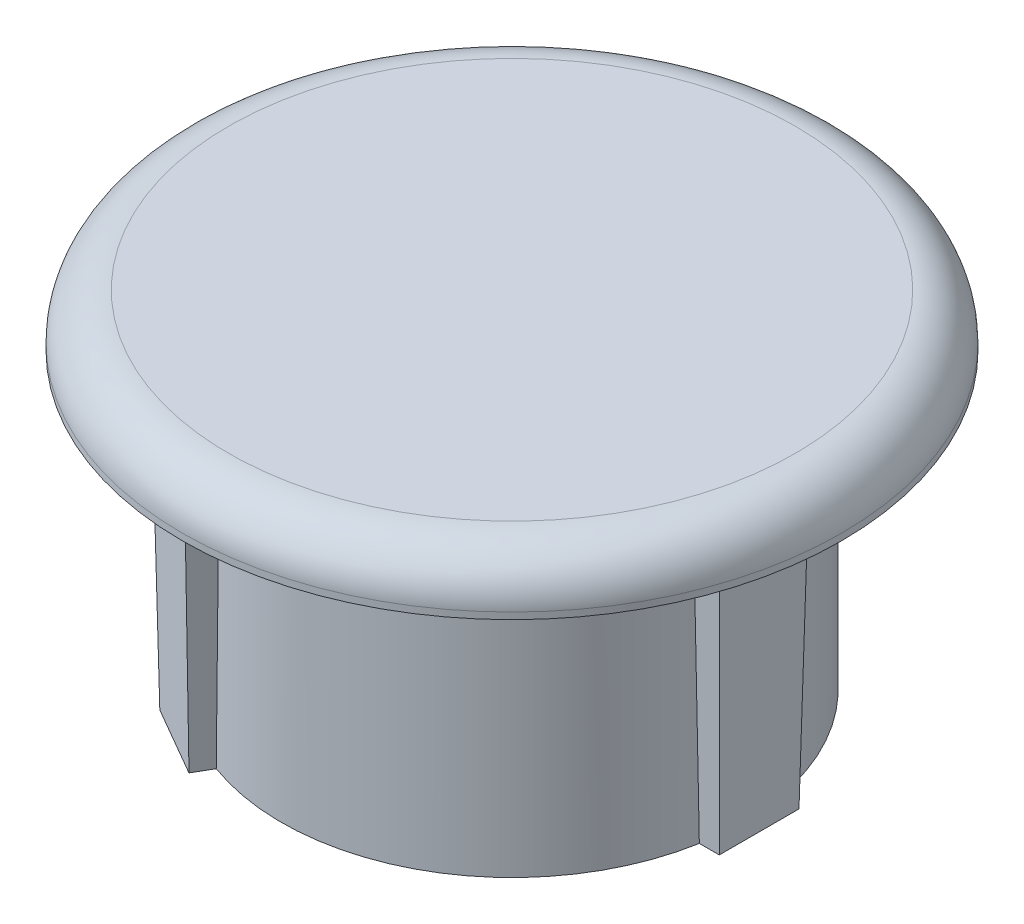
ISO-10303-21;
HEADER;
FILE_DESCRIPTION(('STEP AP214'),'2;1');
FILE_NAME('part.step','',(''),(''),'','','');
FILE_SCHEMA(('AUTOMOTIVE_DESIGN { 1 0 10303 214 1 1 1 1 }'));
ENDSEC;
DATA;
#1=APPLICATION_CONTEXT('core data for automotive mechanical design processes');
#2=APPLICATION_PROTOCOL_DEFINITION('international standard','automotive_design',2000,#1);
#3=PRODUCT_CONTEXT('',#1,'mechanical');
#4=PRODUCT('Part','Part','',(#3));
#5=PRODUCT_RELATED_PRODUCT_CATEGORY('part','',(#4));
#6=PRODUCT_DEFINITION_FORMATION('','',#4);
#7=PRODUCT_DEFINITION_CONTEXT('part definition',#1,'design');
#8=PRODUCT_DEFINITION('design','',#6,#7);
#9=PRODUCT_DEFINITION_SHAPE('','',#8);
#10=(LENGTH_UNIT() NAMED_UNIT(*) SI_UNIT(.MILLI.,.METRE.));
#11=(NAMED_UNIT(*) PLANE_ANGLE_UNIT() SI_UNIT($,.RADIAN.));
#12=(NAMED_UNIT(*) SI_UNIT($,.STERADIAN.) SOLID_ANGLE_UNIT());
#13=UNCERTAINTY_MEASURE_WITH_UNIT(LENGTH_MEASURE(1.E-05),#10,'distance_accuracy_value','');
#14=(GEOMETRIC_REPRESENTATION_CONTEXT(3) GLOBAL_UNCERTAINTY_ASSIGNED_CONTEXT((#13)) GLOBAL_UNIT_ASSIGNED_CONTEXT((#10,
#11,#12)) REPRESENTATION_CONTEXT('',''));
#15=CARTESIAN_POINT('',(0.,0.,0.));
#16=DIRECTION('',(0.,0.,1.));
#17=DIRECTION('',(1.,0.,0.));
#18=AXIS2_PLACEMENT_3D('',#15,#16,#17);
#19=CARTESIAN_POINT('',(0.,0.,0.));
#20=DIRECTION('',(0.,-1.,0.));
#21=DIRECTION('',(0.,0.,-1.));
#22=AXIS2_PLACEMENT_3D('',#19,#20,#21);
#23=CYLINDRICAL_SURFACE('',#22,3.5);
#24=CARTESIAN_POINT('',(0.,-34.6488843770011,0.));
#25=DIRECTION('',(0.865893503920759,-0.0174524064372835,0.499923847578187));
#26=DIRECTION('',(-0.0151142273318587,-0.999847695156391,-0.00872620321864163));
#27=AXIS2_PLACEMENT_3D('',#24,#25,#26);
#28=ELLIPSE('',#27,200.545409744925,3.5);
#29=CARTESIAN_POINT('',(-1.19990387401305,0.,3.28789152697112));
#30=VERTEX_POINT('',#29);
#31=CARTESIAN_POINT('',(-1.12536885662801,4.45,3.31414316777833));
#32=VERTEX_POINT('',#31);
#33=EDGE_CURVE('E147',#30,#32,#28,.F.);
#34=ORIENTED_EDGE('',*,*,#33,.F.);
#35=CARTESIAN_POINT('',(0.,0.,0.));
#36=DIRECTION('',(0.,-1.,0.));
#37=DIRECTION('',(0.,0.,-1.));
#38=AXIS2_PLACEMENT_3D('',#35,#36,#37);
#39=CIRCLE('',#38,3.5);
#40=CARTESIAN_POINT('',(3.44734952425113,0.,0.604798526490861));
#41=VERTEX_POINT('',#40);
#42=EDGE_CURVE('E204',#41,#30,#39,.T.);
#43=ORIENTED_EDGE('',*,*,#42,.F.);
#44=CARTESIAN_POINT('',(0.,-34.6488843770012,0.));
#45=DIRECTION('',(0.,-0.0174524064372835,0.999847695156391));
#46=DIRECTION('',(0.,-0.999847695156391,-0.0174524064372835));
#47=AXIS2_PLACEMENT_3D('',#44,#45,#46);
#48=ELLIPSE('',#47,200.545409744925,3.5);
#49=CARTESIAN_POINT('',(3.43281660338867,4.45,0.68247356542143));
#50=VERTEX_POINT('',#49);
#51=EDGE_CURVE('E194',#50,#41,#48,.F.);
#52=ORIENTED_EDGE('',*,*,#51,.F.);
#53=CARTESIAN_POINT('',(0.,4.45,0.));
#54=DIRECTION('',(0.,-1.,0.));
#55=DIRECTION('',(0.,0.,-1.));
#56=AXIS2_PLACEMENT_3D('',#53,#54,#55);
#57=CIRCLE('',#56,3.5);
#58=EDGE_CURVE('E208',#50,#32,#57,.T.);
#59=ORIENTED_EDGE('',*,*,#58,.T.);
#60=EDGE_LOOP('',(#34,#43,#52,#59));
#61=FACE_BOUND('',#60,.T.);
#62=ADVANCED_FACE('F27',(#61),#23,.T.);
#63=CARTESIAN_POINT('',(0.,-34.6488843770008,0.));
#64=DIRECTION('',(-0.865893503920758,-0.0174524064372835,-0.499923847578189));
#65=DIRECTION('',(0.0151142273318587,-0.999847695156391,0.00872620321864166));
#66=AXIS2_PLACEMENT_3D('',#63,#64,#65);
#67=ELLIPSE('',#66,200.545409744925,3.5);
#68=CARTESIAN_POINT('',(-2.30744774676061,4.45,2.63166960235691));
#69=VERTEX_POINT('',#68);
#70=CARTESIAN_POINT('',(-2.24744565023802,0.,2.68309300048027));
#71=VERTEX_POINT('',#70);
#72=EDGE_CURVE('E131',#69,#71,#67,.F.);
#73=ORIENTED_EDGE('',*,*,#72,.F.);
#74=CARTESIAN_POINT('',(-2.30744774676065,4.45,-2.63166960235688));
#75=VERTEX_POINT('',#74);
#76=EDGE_CURVE('E212',#69,#75,#57,.T.);
#77=ORIENTED_EDGE('',*,*,#76,.T.);
#78=CARTESIAN_POINT('',(0.,-34.6488843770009,0.));
#79=DIRECTION('',(-0.865893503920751,-0.0174524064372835,0.499923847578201));
#80=DIRECTION('',(0.0151142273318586,-0.999847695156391,-0.00872620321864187));
#81=AXIS2_PLACEMENT_3D('',#78,#79,#80);
#82=ELLIPSE('',#81,200.545409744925,3.5);
#83=CARTESIAN_POINT('',(-2.24744565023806,0.,-2.68309300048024));
#84=VERTEX_POINT('',#83);
#85=EDGE_CURVE('E170',#84,#75,#82,.F.);
#86=ORIENTED_EDGE('',*,*,#85,.F.);
#87=EDGE_CURVE('E207',#71,#84,#39,.T.);
#88=ORIENTED_EDGE('',*,*,#87,.F.);
#89=EDGE_LOOP('',(#73,#77,#86,#88));
#90=FACE_BOUND('',#89,.T.);
#91=ADVANCED_FACE('F235',(#90),#23,.T.);
#92=CARTESIAN_POINT('',(0.,0.,0.));
#93=DIRECTION('',(0.,-1.,0.));
#94=DIRECTION('',(0.,0.,-1.));
#95=AXIS2_PLACEMENT_3D('',#92,#93,#94);
#96=CYLINDRICAL_SURFACE('',#95,2.3);
#97=CARTESIAN_POINT('',(0.,0.,0.));
#98=DIRECTION('',(0.,-1.,0.));
#99=DIRECTION('',(0.,0.,-1.));
#100=AXIS2_PLACEMENT_3D('',#97,#98,#99);
#101=CIRCLE('',#100,2.3);
#102=CARTESIAN_POINT('',(0.,0.,-2.3));
#103=VERTEX_POINT('',#102);
#104=EDGE_CURVE('E200',#103,#103,#101,.T.);
#105=ORIENTED_EDGE('',*,*,#104,.T.);
#106=EDGE_LOOP('',(#105));
#107=FACE_BOUND('',#106,.T.);
#108=CARTESIAN_POINT('',(0.,4.,0.));
#109=DIRECTION('',(0.,-1.,0.));
#110=DIRECTION('',(0.,0.,-1.));
#111=AXIS2_PLACEMENT_3D('',#108,#109,#110);
#112=CIRCLE('',#111,2.3);
#113=CARTESIAN_POINT('',(0.,4.,-2.3));
#114=VERTEX_POINT('',#113);
#115=EDGE_CURVE('E11',#114,#114,#112,.T.);
#116=ORIENTED_EDGE('',*,*,#115,.F.);
#117=EDGE_LOOP('',(#116));
#118=FACE_BOUND('',#117,.T.);
#119=ADVANCED_FACE('F29',(#107,#118),#96,.F.);
#120=CARTESIAN_POINT('',(2.3,4.,0.));
#121=DIRECTION('',(0.,-1.,0.));
#122=DIRECTION('',(0.,0.,-1.));
#123=AXIS2_PLACEMENT_3D('',#120,#121,#122);
#124=PLANE('',#123);
#125=ORIENTED_EDGE('',*,*,#115,.T.);
#126=EDGE_LOOP('',(#125));
#127=FACE_BOUND('',#126,.T.);
#128=ADVANCED_FACE('F225',(#127),#124,.T.);
#129=CARTESIAN_POINT('',(0.,5.25,0.));
#130=DIRECTION('',(0.,1.,0.));
#131=DIRECTION('',(0.,0.,1.));
#132=AXIS2_PLACEMENT_3D('',#129,#130,#131);
#133=PLANE('',#132);
#134=CARTESIAN_POINT('',(0.,5.25,0.));
#135=DIRECTION('',(0.,-1.,0.));
#136=DIRECTION('',(0.,0.,-1.));
#137=AXIS2_PLACEMENT_3D('',#134,#135,#136);
#138=CIRCLE('',#137,4.3);
#139=CARTESIAN_POINT('',(0.,5.25,-4.3));
#140=VERTEX_POINT('',#139);
#141=EDGE_CURVE('E35',#140,#140,#138,.T.);
#142=ORIENTED_EDGE('',*,*,#141,.F.);
#143=EDGE_LOOP('',(#142));
#144=FACE_BOUND('',#143,.T.);
#145=ADVANCED_FACE('F223',(#144),#133,.T.);
#146=CARTESIAN_POINT('',(0.,4.55,0.));
#147=DIRECTION('',(0.,-1.,0.));
#148=DIRECTION('',(0.,0.,-1.));
#149=AXIS2_PLACEMENT_3D('',#146,#147,#148);
#150=TOROIDAL_SURFACE('',#149,4.3,0.7);
#151=ORIENTED_EDGE('',*,*,#141,.T.);
#152=EDGE_LOOP('',(#151));
#153=FACE_BOUND('',#152,.T.);
#154=CARTESIAN_POINT('',(0.,4.55,0.));
#155=DIRECTION('',(0.,-1.,0.));
#156=DIRECTION('',(0.,0.,-1.));
#157=AXIS2_PLACEMENT_3D('',#154,#155,#156);
#158=CIRCLE('',#157,5.);
#159=CARTESIAN_POINT('',(0.,4.55,-5.));
#160=VERTEX_POINT('',#159);
#161=EDGE_CURVE('E215',#160,#160,#158,.T.);
#162=ORIENTED_EDGE('',*,*,#161,.F.);
#163=EDGE_LOOP('',(#162));
#164=FACE_BOUND('',#163,.T.);
#165=ADVANCED_FACE('F220',(#153,#164),#150,.T.);
#166=CARTESIAN_POINT('',(0.,0.,0.));
#167=DIRECTION('',(0.,-1.,0.));
#168=DIRECTION('',(0.,0.,-1.));
#169=AXIS2_PLACEMENT_3D('',#166,#167,#168);
#170=CYLINDRICAL_SURFACE('',#169,5.);
#171=ORIENTED_EDGE('',*,*,#161,.T.);
#172=EDGE_LOOP('',(#171));
#173=FACE_BOUND('',#172,.T.);
#174=CARTESIAN_POINT('',(0.,4.45,0.));
#175=DIRECTION('',(0.,-1.,0.));
#176=DIRECTION('',(0.,0.,-1.));
#177=AXIS2_PLACEMENT_3D('',#174,#175,#176);
#178=CIRCLE('',#177,5.);
#179=CARTESIAN_POINT('',(0.,4.45,-5.));
#180=VERTEX_POINT('',#179);
#181=EDGE_CURVE('E211',#180,#180,#178,.T.);
#182=ORIENTED_EDGE('',*,*,#181,.F.);
#183=EDGE_LOOP('',(#182));
#184=FACE_BOUND('',#183,.T.);
#185=ADVANCED_FACE('F231',(#173,#184),#170,.T.);
#186=CARTESIAN_POINT('',(5.,4.45,0.));
#187=DIRECTION('',(0.,-1.,0.));
#188=DIRECTION('',(0.,0.,-1.));
#189=AXIS2_PLACEMENT_3D('',#186,#187,#188);
#190=PLANE('',#189);
#191=DIRECTION('',(0.499999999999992,0.,-0.866025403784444));
#192=VECTOR('',#191,1.);
#193=CARTESIAN_POINT('',(-1.13263531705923,4.45,3.3267290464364));
#194=LINE('',#193,#192);
#195=CARTESIAN_POINT('',(-1.32279807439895,4.45,3.65610060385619));
#196=VERTEX_POINT('',#195);
#197=EDGE_CURVE('E142',#196,#32,#194,.T.);
#198=ORIENTED_EDGE('',*,*,#197,.T.);
#199=ORIENTED_EDGE('',*,*,#58,.F.);
#200=DIRECTION('',(1.,0.,0.));
#201=VECTOR('',#200,1.);
#202=CARTESIAN_POINT('',(3.44734952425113,4.45,0.68247356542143));
#203=LINE('',#202,#201);
#204=CARTESIAN_POINT('',(3.82767503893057,4.45,0.68247356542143));
#205=VERTEX_POINT('',#204);
#206=EDGE_CURVE('E181',#50,#205,#203,.T.);
#207=ORIENTED_EDGE('',*,*,#206,.T.);
#208=DIRECTION('',(0.,0.,-1.));
#209=VECTOR('',#208,1.);
#210=CARTESIAN_POINT('',(3.82767503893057,4.45,0.604798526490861));
#211=LINE('',#210,#209);
#212=CARTESIAN_POINT('',(3.82767503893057,4.45,-0.68247356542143));
#213=VERTEX_POINT('',#212);
#214=EDGE_CURVE('E177',#205,#213,#211,.T.);
#215=ORIENTED_EDGE('',*,*,#214,.T.);
#216=DIRECTION('',(-1.,0.,0.));
#217=VECTOR('',#216,1.);
#218=CARTESIAN_POINT('',(3.44734952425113,4.45,-0.68247356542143));
#219=LINE('',#218,#217);
#220=CARTESIAN_POINT('',(3.43281660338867,4.45,-0.68247356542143));
#221=VERTEX_POINT('',#220);
#222=EDGE_CURVE('E174',#213,#221,#219,.T.);
#223=ORIENTED_EDGE('',*,*,#222,.T.);
#224=CARTESIAN_POINT('',(-1.12536885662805,4.45,-3.31414316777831));
#225=VERTEX_POINT('',#224);
#226=EDGE_CURVE('E206',#225,#221,#57,.T.);
#227=ORIENTED_EDGE('',*,*,#226,.F.);
#228=DIRECTION('',(-0.500000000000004,0.,-0.866025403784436));
#229=VECTOR('',#228,1.);
#230=CARTESIAN_POINT('',(-1.13263531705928,4.45,-3.32672904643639));
#231=LINE('',#230,#229);
#232=CARTESIAN_POINT('',(-1.322798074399,4.45,-3.65610060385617));
#233=VERTEX_POINT('',#232);
#234=EDGE_CURVE('E157',#225,#233,#231,.T.);
#235=ORIENTED_EDGE('',*,*,#234,.T.);
#236=DIRECTION('',(-0.866025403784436,0.,0.500000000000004));
#237=VECTOR('',#236,1.);
#238=CARTESIAN_POINT('',(-1.39006663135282,4.45,-3.61726308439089));
#239=LINE('',#238,#237);
#240=CARTESIAN_POINT('',(-2.5048769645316,4.45,-2.97362703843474));
#241=VERTEX_POINT('',#240);
#242=EDGE_CURVE('E153',#233,#241,#239,.T.);
#243=ORIENTED_EDGE('',*,*,#242,.T.);
#244=DIRECTION('',(0.500000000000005,0.,0.866025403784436));
#245=VECTOR('',#244,1.);
#246=CARTESIAN_POINT('',(-2.31471420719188,4.45,-2.64425548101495));
#247=LINE('',#246,#245);
#248=EDGE_CURVE('E150',#241,#75,#247,.T.);
#249=ORIENTED_EDGE('',*,*,#248,.T.);
#250=ORIENTED_EDGE('',*,*,#76,.F.);
#251=DIRECTION('',(-0.499999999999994,0.,0.866025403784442));
#252=VECTOR('',#251,1.);
#253=CARTESIAN_POINT('',(-2.31471420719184,4.45,2.64425548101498));
#254=LINE('',#253,#252);
#255=CARTESIAN_POINT('',(-2.50487696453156,4.45,2.97362703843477));
#256=VERTEX_POINT('',#255);
#257=EDGE_CURVE('E144',#69,#256,#254,.T.);
#258=ORIENTED_EDGE('',*,*,#257,.T.);
#259=DIRECTION('',(0.866025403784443,0.,0.499999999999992));
#260=VECTOR('',#259,1.);
#261=CARTESIAN_POINT('',(-2.43760840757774,4.45,3.01246455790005));
#262=LINE('',#261,#260);
#263=EDGE_CURVE('E123',#256,#196,#262,.T.);
#264=ORIENTED_EDGE('',*,*,#263,.T.);
#265=EDGE_LOOP('',(#198,#199,#207,#215,#223,#227,#235,#243,#249,#250,#258,#264));
#266=FACE_BOUND('',#265,.T.);
#267=ORIENTED_EDGE('',*,*,#181,.T.);
#268=EDGE_LOOP('',(#267));
#269=FACE_BOUND('',#268,.T.);
#270=ADVANCED_FACE('F248',(#266,#269),#190,.T.);
#271=CARTESIAN_POINT('',(0.,-34.6488843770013,0.));
#272=DIRECTION('',(0.865893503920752,-0.0174524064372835,-0.4999238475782));
#273=DIRECTION('',(-0.0151142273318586,-0.999847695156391,0.00872620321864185));
#274=AXIS2_PLACEMENT_3D('',#271,#272,#273);
#275=ELLIPSE('',#274,200.545409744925,3.5);
#276=CARTESIAN_POINT('',(-1.1999038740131,0.,-3.2878915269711));
#277=VERTEX_POINT('',#276);
#278=EDGE_CURVE('E168',#225,#277,#275,.F.);
#279=ORIENTED_EDGE('',*,*,#278,.F.);
#280=ORIENTED_EDGE('',*,*,#226,.T.);
#281=CARTESIAN_POINT('',(0.,-34.6488843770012,0.));
#282=DIRECTION('',(0.,-0.0174524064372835,-0.999847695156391));
#283=DIRECTION('',(0.,-0.999847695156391,0.0174524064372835));
#284=AXIS2_PLACEMENT_3D('',#281,#282,#283);
#285=ELLIPSE('',#284,200.545409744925,3.5);
#286=CARTESIAN_POINT('',(3.44734952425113,0.,-0.604798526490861));
#287=VERTEX_POINT('',#286);
#288=EDGE_CURVE('E197',#287,#221,#285,.F.);
#289=ORIENTED_EDGE('',*,*,#288,.F.);
#290=EDGE_CURVE('E203',#277,#287,#39,.T.);
#291=ORIENTED_EDGE('',*,*,#290,.F.);
#292=EDGE_LOOP('',(#279,#280,#289,#291));
#293=FACE_BOUND('',#292,.T.);
#294=ADVANCED_FACE('F238',(#293),#23,.T.);
#295=CARTESIAN_POINT('',(2.3,0.,0.));
#296=DIRECTION('',(0.,-1.,0.));
#297=DIRECTION('',(0.,0.,-1.));
#298=AXIS2_PLACEMENT_3D('',#295,#296,#297);
#299=PLANE('',#298);
#300=ORIENTED_EDGE('',*,*,#42,.T.);
#301=DIRECTION('',(-0.499999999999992,0.,0.866025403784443));
#302=VECTOR('',#301,1.);
#303=CARTESIAN_POINT('',(-1.19990387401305,0.,3.28789152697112));
#304=LINE('',#303,#302);
#305=CARTESIAN_POINT('',(-1.35122911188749,0.,3.54999452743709));
#306=VERTEX_POINT('',#305);
#307=EDGE_CURVE('E127',#30,#306,#304,.T.);
#308=ORIENTED_EDGE('',*,*,#307,.T.);
#309=DIRECTION('',(-0.866025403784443,0.,-0.499999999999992));
#310=VECTOR('',#309,1.);
#311=CARTESIAN_POINT('',(-2.39877088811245,0.,2.94519600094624));
#312=LINE('',#311,#310);
#313=CARTESIAN_POINT('',(-2.39877088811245,0.,2.94519600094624));
#314=VERTEX_POINT('',#313);
#315=EDGE_CURVE('E120',#306,#314,#312,.T.);
#316=ORIENTED_EDGE('',*,*,#315,.T.);
#317=DIRECTION('',(0.499999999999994,0.,-0.866025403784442));
#318=VECTOR('',#317,1.);
#319=CARTESIAN_POINT('',(-2.24744565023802,0.,2.68309300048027));
#320=LINE('',#319,#318);
#321=EDGE_CURVE('E42',#314,#71,#320,.T.);
#322=ORIENTED_EDGE('',*,*,#321,.T.);
#323=ORIENTED_EDGE('',*,*,#87,.T.);
#324=DIRECTION('',(-0.500000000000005,0.,-0.866025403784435));
#325=VECTOR('',#324,1.);
#326=CARTESIAN_POINT('',(-2.24744565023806,0.,-2.68309300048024));
#327=LINE('',#326,#325);
#328=CARTESIAN_POINT('',(-2.3987708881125,0.,-2.9451960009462));
#329=VERTEX_POINT('',#328);
#330=EDGE_CURVE('E160',#84,#329,#327,.T.);
#331=ORIENTED_EDGE('',*,*,#330,.T.);
#332=DIRECTION('',(0.866025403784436,0.,-0.500000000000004));
#333=VECTOR('',#332,1.);
#334=CARTESIAN_POINT('',(-1.35122911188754,0.,-3.54999452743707));
#335=LINE('',#334,#333);
#336=CARTESIAN_POINT('',(-1.35122911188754,0.,-3.54999452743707));
#337=VERTEX_POINT('',#336);
#338=EDGE_CURVE('E149',#329,#337,#335,.T.);
#339=ORIENTED_EDGE('',*,*,#338,.T.);
#340=DIRECTION('',(0.500000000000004,0.,0.866025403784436));
#341=VECTOR('',#340,1.);
#342=CARTESIAN_POINT('',(-1.1999038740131,0.,-3.2878915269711));
#343=LINE('',#342,#341);
#344=EDGE_CURVE('E49',#337,#277,#343,.T.);
#345=ORIENTED_EDGE('',*,*,#344,.T.);
#346=ORIENTED_EDGE('',*,*,#290,.T.);
#347=DIRECTION('',(1.,0.,0.));
#348=VECTOR('',#347,1.);
#349=CARTESIAN_POINT('',(3.44734952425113,0.,-0.604798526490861));
#350=LINE('',#349,#348);
#351=CARTESIAN_POINT('',(3.75,0.,-0.604798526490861));
#352=VERTEX_POINT('',#351);
#353=EDGE_CURVE('E186',#287,#352,#350,.T.);
#354=ORIENTED_EDGE('',*,*,#353,.T.);
#355=DIRECTION('',(0.,0.,1.));
#356=VECTOR('',#355,1.);
#357=CARTESIAN_POINT('',(3.75,0.,0.604798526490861));
#358=LINE('',#357,#356);
#359=CARTESIAN_POINT('',(3.75,0.,0.604798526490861));
#360=VERTEX_POINT('',#359);
#361=EDGE_CURVE('E173',#352,#360,#358,.T.);
#362=ORIENTED_EDGE('',*,*,#361,.T.);
#363=DIRECTION('',(-1.,0.,0.));
#364=VECTOR('',#363,1.);
#365=CARTESIAN_POINT('',(3.44734952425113,0.,0.604798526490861));
#366=LINE('',#365,#364);
#367=EDGE_CURVE('E184',#360,#41,#366,.T.);
#368=ORIENTED_EDGE('',*,*,#367,.T.);
#369=EDGE_LOOP('',(#300,#308,#316,#322,#323,#331,#339,#345,#346,#354,#362,#368));
#370=FACE_BOUND('',#369,.T.);
#371=ORIENTED_EDGE('',*,*,#104,.F.);
#372=EDGE_LOOP('',(#371));
#373=FACE_BOUND('',#372,.T.);
#374=ADVANCED_FACE('F135',(#370,#373),#299,.T.);
#375=CARTESIAN_POINT('',(3.75,0.,0.604798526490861));
#376=DIRECTION('',(0.999847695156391,-0.0174524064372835,0.));
#377=DIRECTION('',(0.0174524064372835,0.999847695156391,0.));
#378=AXIS2_PLACEMENT_3D('',#375,#376,#377);
#379=PLANE('',#378);
#380=ORIENTED_EDGE('',*,*,#214,.F.);
#381=DIRECTION('',(-0.0174497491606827,-0.999695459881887,-0.0174497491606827));
#382=VECTOR('',#381,1.);
#383=CARTESIAN_POINT('',(3.75,0.,0.604798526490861));
#384=LINE('',#383,#382);
#385=EDGE_CURVE('E189',#205,#360,#384,.T.);
#386=ORIENTED_EDGE('',*,*,#385,.T.);
#387=ORIENTED_EDGE('',*,*,#361,.F.);
#388=DIRECTION('',(-0.0174497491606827,-0.999695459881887,0.0174497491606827));
#389=VECTOR('',#388,1.);
#390=CARTESIAN_POINT('',(3.74990784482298,-0.00527956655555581,-0.604706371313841));
#391=LINE('',#390,#389);
#392=EDGE_CURVE('E178',#213,#352,#391,.T.);
#393=ORIENTED_EDGE('',*,*,#392,.F.);
#394=EDGE_LOOP('',(#380,#386,#387,#393));
#395=FACE_BOUND('',#394,.T.);
#396=ADVANCED_FACE('F254',(#395),#379,.T.);
#397=CARTESIAN_POINT('',(3.44734952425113,0.,-0.604798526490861));
#398=DIRECTION('',(0.,-0.0174524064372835,-0.999847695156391));
#399=DIRECTION('',(0.,0.999847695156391,-0.0174524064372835));
#400=AXIS2_PLACEMENT_3D('',#397,#398,#399);
#401=PLANE('',#400);
#402=ORIENTED_EDGE('',*,*,#353,.F.);
#403=ORIENTED_EDGE('',*,*,#288,.T.);
#404=ORIENTED_EDGE('',*,*,#222,.F.);
#405=ORIENTED_EDGE('',*,*,#392,.T.);
#406=EDGE_LOOP('',(#402,#403,#404,#405));
#407=FACE_BOUND('',#406,.T.);
#408=ADVANCED_FACE('F276',(#407),#401,.T.);
#409=CARTESIAN_POINT('',(3.44734952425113,0.,0.604798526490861));
#410=DIRECTION('',(0.,-0.0174524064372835,0.999847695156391));
#411=DIRECTION('',(0.,-0.999847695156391,-0.0174524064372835));
#412=AXIS2_PLACEMENT_3D('',#409,#410,#411);
#413=PLANE('',#412);
#414=ORIENTED_EDGE('',*,*,#206,.F.);
#415=ORIENTED_EDGE('',*,*,#51,.T.);
#416=ORIENTED_EDGE('',*,*,#367,.F.);
#417=ORIENTED_EDGE('',*,*,#385,.F.);
#418=EDGE_LOOP('',(#414,#415,#416,#417));
#419=FACE_BOUND('',#418,.T.);
#420=ADVANCED_FACE('F285',(#419),#413,.T.);
#421=CARTESIAN_POINT('',(-1.35122911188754,0.,-3.54999452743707));
#422=DIRECTION('',(-0.4999238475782,-0.0174524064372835,-0.865893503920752));
#423=DIRECTION('',(-0.866025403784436,0.,0.500000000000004));
#424=AXIS2_PLACEMENT_3D('',#421,#422,#423);
#425=PLANE('',#424);
#426=ORIENTED_EDGE('',*,*,#242,.F.);
#427=DIRECTION('',(-0.00638705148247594,-0.999695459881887,0.0238368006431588));
#428=VECTOR('',#427,1.);
#429=CARTESIAN_POINT('',(-1.35122911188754,0.,-3.54999452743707));
#430=LINE('',#429,#428);
#431=EDGE_CURVE('E163',#233,#337,#430,.T.);
#432=ORIENTED_EDGE('',*,*,#431,.T.);
#433=ORIENTED_EDGE('',*,*,#338,.F.);
#434=DIRECTION('',(0.0238368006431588,-0.999695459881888,0.00638705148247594));
#435=VECTOR('',#434,1.);
#436=CARTESIAN_POINT('',(-2.3986450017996,-0.00527956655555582,-2.94516226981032));
#437=LINE('',#436,#435);
#438=EDGE_CURVE('E154',#241,#329,#437,.T.);
#439=ORIENTED_EDGE('',*,*,#438,.F.);
#440=EDGE_LOOP('',(#426,#432,#433,#439));
#441=FACE_BOUND('',#440,.T.);
#442=ADVANCED_FACE('F271',(#441),#425,.T.);
#443=CARTESIAN_POINT('',(-2.24744565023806,0.,-2.68309300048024));
#444=DIRECTION('',(-0.865893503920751,-0.0174524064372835,0.499923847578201));
#445=DIRECTION('',(0.500000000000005,0.,0.866025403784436));
#446=AXIS2_PLACEMENT_3D('',#443,#444,#445);
#447=PLANE('',#446);
#448=ORIENTED_EDGE('',*,*,#330,.F.);
#449=ORIENTED_EDGE('',*,*,#85,.T.);
#450=ORIENTED_EDGE('',*,*,#248,.F.);
#451=ORIENTED_EDGE('',*,*,#438,.T.);
#452=EDGE_LOOP('',(#448,#449,#450,#451));
#453=FACE_BOUND('',#452,.T.);
#454=ADVANCED_FACE('F267',(#453),#447,.T.);
#455=CARTESIAN_POINT('',(-1.1999038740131,0.,-3.2878915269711));
#456=DIRECTION('',(0.865893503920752,-0.0174524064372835,-0.4999238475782));
#457=DIRECTION('',(-0.500000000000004,0.,-0.866025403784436));
#458=AXIS2_PLACEMENT_3D('',#455,#456,#457);
#459=PLANE('',#458);
#460=ORIENTED_EDGE('',*,*,#234,.F.);
#461=ORIENTED_EDGE('',*,*,#278,.T.);
#462=ORIENTED_EDGE('',*,*,#344,.F.);
#463=ORIENTED_EDGE('',*,*,#431,.F.);
#464=EDGE_LOOP('',(#460,#461,#462,#463));
#465=FACE_BOUND('',#464,.T.);
#466=ADVANCED_FACE('F273',(#465),#459,.T.);
#467=CARTESIAN_POINT('',(-2.39877088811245,0.,2.94519600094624));
#468=DIRECTION('',(-0.499923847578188,-0.0174524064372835,0.865893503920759));
#469=DIRECTION('',(0.866025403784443,0.,0.499999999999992));
#470=AXIS2_PLACEMENT_3D('',#467,#468,#469);
#471=PLANE('',#470);
#472=ORIENTED_EDGE('',*,*,#263,.F.);
#473=DIRECTION('',(0.0238368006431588,-0.999695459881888,-0.00638705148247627));
#474=VECTOR('',#473,1.);
#475=CARTESIAN_POINT('',(-2.39877088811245,0.,2.94519600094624));
#476=LINE('',#475,#474);
#477=EDGE_CURVE('E117',#256,#314,#476,.T.);
#478=ORIENTED_EDGE('',*,*,#477,.T.);
#479=ORIENTED_EDGE('',*,*,#315,.F.);
#480=DIRECTION('',(-0.00638705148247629,-0.999695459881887,-0.0238368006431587));
#481=VECTOR('',#480,1.);
#482=CARTESIAN_POINT('',(-1.35126284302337,-0.00527956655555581,3.54986864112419));
#483=LINE('',#482,#481);
#484=EDGE_CURVE('E126',#196,#306,#483,.T.);
#485=ORIENTED_EDGE('',*,*,#484,.F.);
#486=EDGE_LOOP('',(#472,#478,#479,#485));
#487=FACE_BOUND('',#486,.T.);
#488=ADVANCED_FACE('F118',(#487),#471,.T.);
#489=CARTESIAN_POINT('',(-1.19990387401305,0.,3.28789152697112));
#490=DIRECTION('',(0.865893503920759,-0.0174524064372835,0.499923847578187));
#491=DIRECTION('',(0.499999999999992,0.,-0.866025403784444));
#492=AXIS2_PLACEMENT_3D('',#489,#490,#491);
#493=PLANE('',#492);
#494=ORIENTED_EDGE('',*,*,#307,.F.);
#495=ORIENTED_EDGE('',*,*,#33,.T.);
#496=ORIENTED_EDGE('',*,*,#197,.F.);
#497=ORIENTED_EDGE('',*,*,#484,.T.);
#498=EDGE_LOOP('',(#494,#495,#496,#497));
#499=FACE_BOUND('',#498,.T.);
#500=ADVANCED_FACE('F288',(#499),#493,.T.);
#501=CARTESIAN_POINT('',(-2.24744565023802,0.,2.68309300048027));
#502=DIRECTION('',(-0.865893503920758,-0.0174524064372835,-0.499923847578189));
#503=DIRECTION('',(-0.499999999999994,0.,0.866025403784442));
#504=AXIS2_PLACEMENT_3D('',#501,#502,#503);
#505=PLANE('',#504);
#506=ORIENTED_EDGE('',*,*,#257,.F.);
#507=ORIENTED_EDGE('',*,*,#72,.T.);
#508=ORIENTED_EDGE('',*,*,#321,.F.);
#509=ORIENTED_EDGE('',*,*,#477,.F.);
#510=EDGE_LOOP('',(#506,#507,#508,#509));
#511=FACE_BOUND('',#510,.T.);
#512=ADVANCED_FACE('F129',(#511),#505,.T.);
#513=CLOSED_SHELL('',(#62,#91,#119,#128,#145,#165,#185,#270,#294,#374,#396,#408,#420,#442,#454,
#466,#488,#500,#512));
#514=MANIFOLD_SOLID_BREP('B2',#513);
#515=ADVANCED_BREP_SHAPE_REPRESENTATION('',(#18,#514),#14);
#516=SHAPE_DEFINITION_REPRESENTATION(#9,#515);
ENDSEC;
END-ISO-10303-21;
